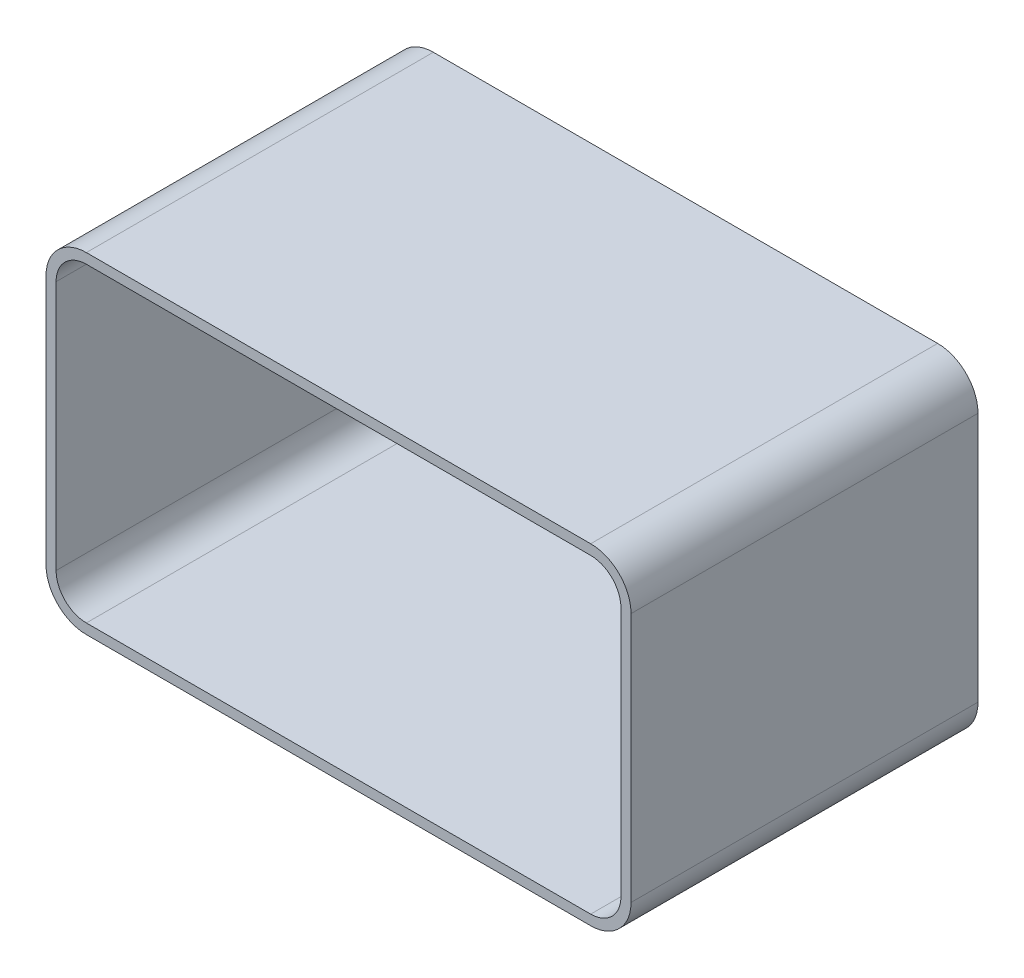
from build123d import *

# Parameters (mm, degrees)
SKETCH1_W        = 290
SKETCH1_H        = 164
BOX_DEPTH        = 172
OUTSIDECORNERS_R = 20
SHELL1_T         = -5


with BuildPart() as part:
    # Sketch1 → Box (new body)
    with BuildSketch(Plane.XY):
        with Locations((145, 82)):
            Rectangle(SKETCH1_W, SKETCH1_H)
    extrude(amount=-BOX_DEPTH)

    # OutsideCorners
    outsidecorners_edges = [part.edges().sort_by_distance(p)[0] for p in [
        (0, 164, -86),
        (290, 164, -86),
        (290, 0, -86),
        (0, 0, -86),
    ]]
    fillet(outsidecorners_edges, radius=OUTSIDECORNERS_R)

    # Shell1
    shell1_openings = [part.faces().sort_by_distance(p)[0] for p in [
        (145, 82, 0),
    ]]
    offset(amount=SHELL1_T, openings=shell1_openings, kind=Kind.INTERSECTION)


solid = part.part
